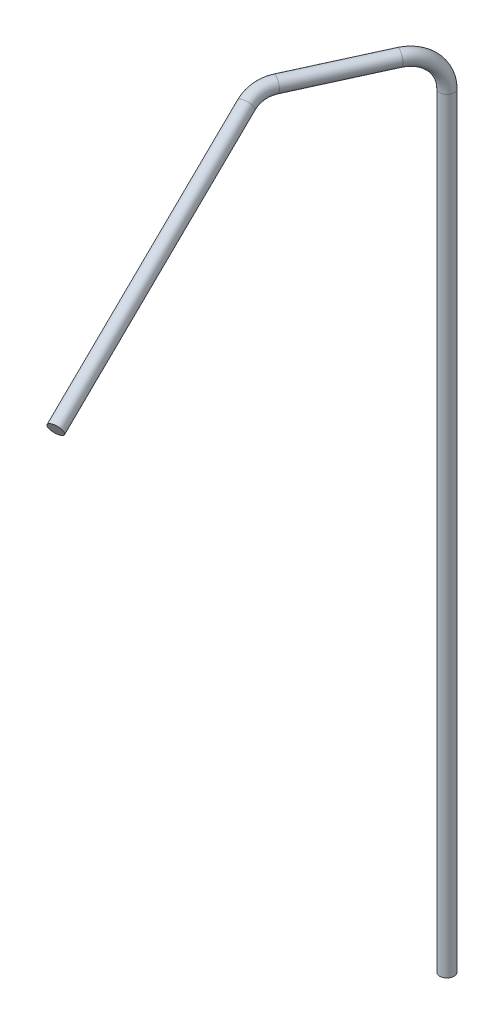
ISO-10303-21;
HEADER;
FILE_DESCRIPTION(('STEP AP214'),'2;1');
FILE_NAME('part.step','',(''),(''),'','','');
FILE_SCHEMA(('AUTOMOTIVE_DESIGN { 1 0 10303 214 1 1 1 1 }'));
ENDSEC;
DATA;
#1=APPLICATION_CONTEXT('core data for automotive mechanical design processes');
#2=APPLICATION_PROTOCOL_DEFINITION('international standard','automotive_design',2000,#1);
#3=PRODUCT_CONTEXT('',#1,'mechanical');
#4=PRODUCT('Part','Part','',(#3));
#5=PRODUCT_RELATED_PRODUCT_CATEGORY('part','',(#4));
#6=PRODUCT_DEFINITION_FORMATION('','',#4);
#7=PRODUCT_DEFINITION_CONTEXT('part definition',#1,'design');
#8=PRODUCT_DEFINITION('design','',#6,#7);
#9=PRODUCT_DEFINITION_SHAPE('','',#8);
#10=(LENGTH_UNIT() NAMED_UNIT(*) SI_UNIT(.MILLI.,.METRE.));
#11=(NAMED_UNIT(*) PLANE_ANGLE_UNIT() SI_UNIT($,.RADIAN.));
#12=(NAMED_UNIT(*) SI_UNIT($,.STERADIAN.) SOLID_ANGLE_UNIT());
#13=UNCERTAINTY_MEASURE_WITH_UNIT(LENGTH_MEASURE(1.E-05),#10,'distance_accuracy_value','');
#14=(GEOMETRIC_REPRESENTATION_CONTEXT(3) GLOBAL_UNCERTAINTY_ASSIGNED_CONTEXT((#13)) GLOBAL_UNIT_ASSIGNED_CONTEXT((#10,
#11,#12)) REPRESENTATION_CONTEXT('',''));
#15=CARTESIAN_POINT('',(0.,0.,0.));
#16=DIRECTION('',(0.,0.,1.));
#17=DIRECTION('',(1.,0.,0.));
#18=AXIS2_PLACEMENT_3D('',#15,#16,#17);
#19=CARTESIAN_POINT('',(0.00647766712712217,-56.6921259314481,163.561686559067));
#20=DIRECTION('',(0.199985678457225,-0.45276475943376,0.868912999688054));
#21=DIRECTION('',(-0.458716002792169,0.740368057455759,0.491360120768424));
#22=AXIS2_PLACEMENT_3D('',#19,#20,#21);
#23=PLANE('',#22);
#24=CARTESIAN_POINT('',(0.00647766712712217,-56.6921259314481,163.561686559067));
#25=DIRECTION('',(-0.199985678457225,0.45276475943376,-0.868912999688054));
#26=DIRECTION('',(-0.458716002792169,0.740368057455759,0.491360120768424));
#27=AXIS2_PLACEMENT_3D('',#24,#25,#26);
#28=CIRCLE('',#27,3.);
#29=CARTESIAN_POINT('',(-1.36967034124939,-54.4710217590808,165.035766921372));
#30=VERTEX_POINT('',#29);
#31=EDGE_CURVE('E74',#30,#30,#28,.T.);
#32=ORIENTED_EDGE('',*,*,#31,.F.);
#33=EDGE_LOOP('',(#32));
#34=FACE_BOUND('',#33,.T.);
#35=ADVANCED_FACE('F45',(#34),#23,.T.);
#36=CARTESIAN_POINT('',(0.,-335.,0.));
#37=DIRECTION('',(0.,1.,0.));
#38=DIRECTION('',(0.,0.,-1.));
#39=AXIS2_PLACEMENT_3D('',#36,#37,#38);
#40=PLANE('',#39);
#41=CARTESIAN_POINT('',(0.,-335.,0.));
#42=DIRECTION('',(0.,-1.,0.));
#43=DIRECTION('',(0.,0.,-1.));
#44=AXIS2_PLACEMENT_3D('',#41,#42,#43);
#45=CIRCLE('',#44,3.);
#46=CARTESIAN_POINT('',(0.,-335.,-3.));
#47=VERTEX_POINT('',#46);
#48=EDGE_CURVE('E10',#47,#47,#45,.T.);
#49=ORIENTED_EDGE('',*,*,#48,.T.);
#50=EDGE_LOOP('',(#49));
#51=FACE_BOUND('',#50,.T.);
#52=ADVANCED_FACE('F83',(#51),#40,.F.);
#53=CARTESIAN_POINT('',(0.00647766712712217,-56.6921259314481,163.561686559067));
#54=DIRECTION('',(-0.199985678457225,0.45276475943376,-0.868912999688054));
#55=DIRECTION('',(0.,-0.886827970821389,-0.46209971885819));
#56=AXIS2_PLACEMENT_3D('',#53,#54,#55);
#57=CYLINDRICAL_SURFACE('',#56,3.);
#58=CARTESIAN_POINT('',(-23.7918180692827,-2.81311955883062,60.1610395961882));
#59=DIRECTION('',(-0.199985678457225,0.45276475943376,-0.868912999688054));
#60=DIRECTION('',(-0.458716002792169,0.740368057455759,0.491360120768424));
#61=AXIS2_PLACEMENT_3D('',#58,#59,#60);
#62=CIRCLE('',#61,3.);
#63=CARTESIAN_POINT('',(-26.1557044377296,-1.45482528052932,61.4128694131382));
#64=VERTEX_POINT('',#63);
#65=EDGE_CURVE('E70',#64,#64,#62,.T.);
#66=ORIENTED_EDGE('',*,*,#65,.F.);
#67=EDGE_LOOP('',(#66));
#68=FACE_BOUND('',#67,.T.);
#69=ORIENTED_EDGE('',*,*,#31,.T.);
#70=EDGE_LOOP('',(#69));
#71=FACE_BOUND('',#70,.T.);
#72=ADVANCED_FACE('F80',(#68,#71),#57,.T.);
#73=CARTESIAN_POINT('',(-11.9723862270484,-9.60459095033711,53.9018905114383));
#74=DIRECTION('',(0.582341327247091,0.768119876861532,0.266215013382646));
#75=DIRECTION('',(-0.796876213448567,0.604142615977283,0.));
#76=AXIS2_PLACEMENT_3D('',#73,#74,#75);
#77=TOROIDAL_SURFACE('',#76,15.,3.);
#78=CARTESIAN_POINT('',(-22.4511550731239,1.6306400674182E-13,49.111563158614));
#79=DIRECTION('',(0.415762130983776,0.,-0.909473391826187));
#80=DIRECTION('',(-0.378124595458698,0.909473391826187,-0.172858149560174));
#81=AXIS2_PLACEMENT_3D('',#78,#79,#80);
#82=CIRCLE('',#81,3.);
#83=CARTESIAN_POINT('',(-24.546908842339,1.92091819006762,48.1534976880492));
#84=VERTEX_POINT('',#83);
#85=EDGE_CURVE('E64',#84,#84,#82,.T.);
#86=CARTESIAN_POINT('',(-11.9723862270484,-9.60459095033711,53.9018905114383));
#87=DIRECTION('',(0.582341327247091,0.768119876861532,0.266215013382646));
#88=DIRECTION('',(-0.796876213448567,0.604142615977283,0.));
#89=AXIS2_PLACEMENT_3D('',#86,#87,#88);
#90=CIRCLE('',#89,18.);
#91=EDGE_CURVE('',#84,#64,#90,.T.);
#92=ORIENTED_EDGE('',*,*,#85,.F.);
#93=ORIENTED_EDGE('',*,*,#65,.T.);
#94=ORIENTED_EDGE('',*,*,#91,.T.);
#95=ORIENTED_EDGE('',*,*,#91,.F.);
#96=EDGE_LOOP('',(#92,#94,#93,#95));
#97=FACE_BOUND('',#96,.T.);
#98=ADVANCED_FACE('F90',(#97),#77,.T.);
#99=CARTESIAN_POINT('',(-22.4511550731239,1.72079114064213E-13,49.111563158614));
#100=DIRECTION('',(0.415762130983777,0.,-0.909473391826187));
#101=DIRECTION('',(0.909473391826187,0.,0.415762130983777));
#102=AXIS2_PLACEMENT_3D('',#99,#100,#101);
#103=CYLINDRICAL_SURFACE('',#102,3.);
#104=CARTESIAN_POINT('',(-6.23643196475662,0.,13.6421008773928));
#105=DIRECTION('',(0.415762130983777,0.,-0.909473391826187));
#106=DIRECTION('',(-0.378124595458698,0.909473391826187,-0.172858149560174));
#107=AXIS2_PLACEMENT_3D('',#104,#105,#106);
#108=CIRCLE('',#107,3.);
#109=CARTESIAN_POINT('',(-6.23643196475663,3.00000000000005,13.6421008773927));
#110=VERTEX_POINT('',#109);
#111=EDGE_CURVE('E58',#110,#110,#108,.T.);
#112=ORIENTED_EDGE('',*,*,#111,.F.);
#113=EDGE_LOOP('',(#112));
#114=FACE_BOUND('',#113,.T.);
#115=ORIENTED_EDGE('',*,*,#85,.T.);
#116=EDGE_LOOP('',(#115));
#117=FACE_BOUND('',#116,.T.);
#118=ADVANCED_FACE('F101',(#114,#117),#103,.T.);
#119=CARTESIAN_POINT('',(-6.23643196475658,-15.,13.6421008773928));
#120=DIRECTION('',(0.909473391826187,0.,0.415762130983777));
#121=DIRECTION('',(-0.415762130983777,0.,0.909473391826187));
#122=AXIS2_PLACEMENT_3D('',#119,#120,#121);
#123=TOROIDAL_SURFACE('',#122,15.,3.);
#124=CARTESIAN_POINT('',(0.,-15.,2.01342897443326E-13));
#125=DIRECTION('',(0.,-1.,0.));
#126=DIRECTION('',(0.,0.,-1.));
#127=AXIS2_PLACEMENT_3D('',#124,#125,#126);
#128=CIRCLE('',#127,3.);
#129=CARTESIAN_POINT('',(1.24728639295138,-15.,-2.72842017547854));
#130=VERTEX_POINT('',#129);
#131=EDGE_CURVE('E52',#130,#130,#128,.T.);
#132=CARTESIAN_POINT('',(-6.23643196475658,-15.,13.6421008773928));
#133=DIRECTION('',(0.909473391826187,0.,0.415762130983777));
#134=DIRECTION('',(-0.415762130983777,0.,0.909473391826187));
#135=AXIS2_PLACEMENT_3D('',#132,#133,#134);
#136=CIRCLE('',#135,18.);
#137=EDGE_CURVE('',#130,#110,#136,.T.);
#138=ORIENTED_EDGE('',*,*,#131,.F.);
#139=ORIENTED_EDGE('',*,*,#111,.T.);
#140=ORIENTED_EDGE('',*,*,#137,.T.);
#141=ORIENTED_EDGE('',*,*,#137,.F.);
#142=EDGE_LOOP('',(#138,#140,#139,#141));
#143=FACE_BOUND('',#142,.T.);
#144=ADVANCED_FACE('F97',(#143),#123,.T.);
#145=CARTESIAN_POINT('',(0.,-15.,0.));
#146=DIRECTION('',(0.,-1.,0.));
#147=DIRECTION('',(0.,0.,1.));
#148=AXIS2_PLACEMENT_3D('',#145,#146,#147);
#149=CYLINDRICAL_SURFACE('',#148,3.);
#150=ORIENTED_EDGE('',*,*,#48,.F.);
#151=EDGE_LOOP('',(#150));
#152=FACE_BOUND('',#151,.T.);
#153=ORIENTED_EDGE('',*,*,#131,.T.);
#154=EDGE_LOOP('',(#153));
#155=FACE_BOUND('',#154,.T.);
#156=ADVANCED_FACE('F94',(#152,#155),#149,.T.);
#157=CLOSED_SHELL('',(#35,#52,#72,#98,#118,#144,#156));
#158=MANIFOLD_SOLID_BREP('B2',#157);
#159=ADVANCED_BREP_SHAPE_REPRESENTATION('',(#18,#158),#14);
#160=SHAPE_DEFINITION_REPRESENTATION(#9,#159);
ENDSEC;
END-ISO-10303-21;
